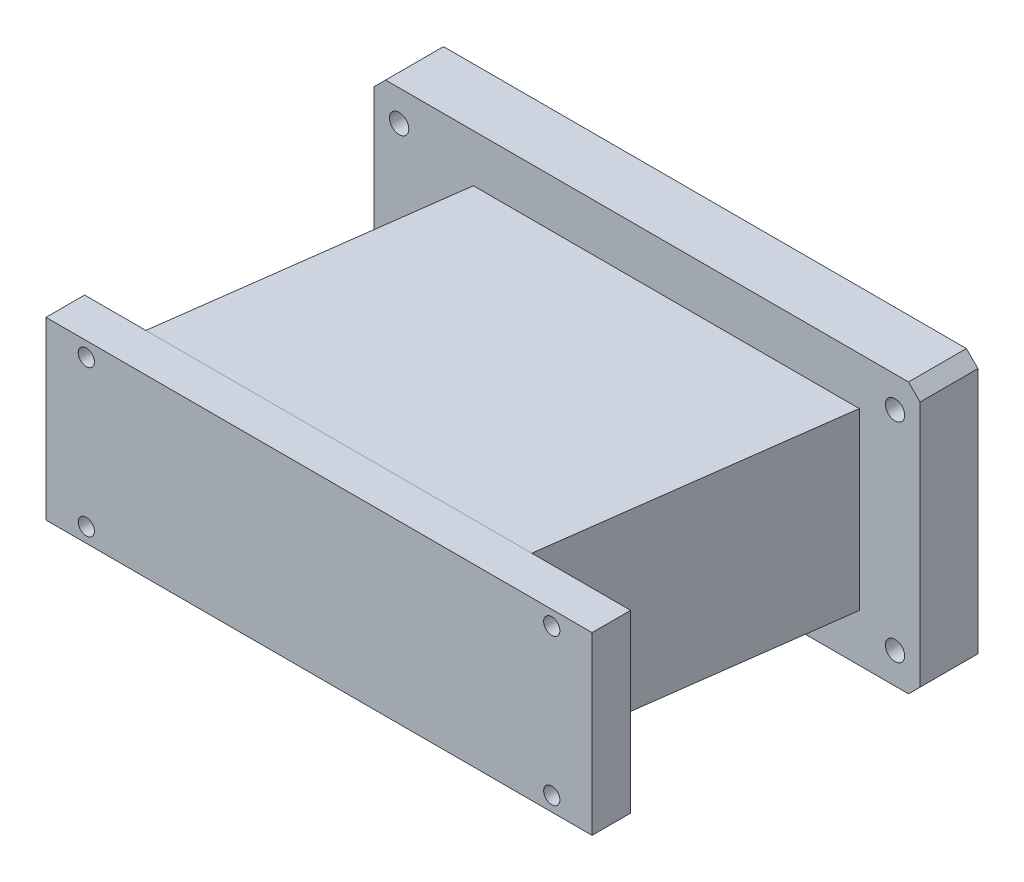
ISO-10303-21;
HEADER;
FILE_DESCRIPTION(('STEP AP214'),'2;1');
FILE_NAME('part.step','',(''),(''),'','','');
FILE_SCHEMA(('AUTOMOTIVE_DESIGN { 1 0 10303 214 1 1 1 1 }'));
ENDSEC;
DATA;
#1=APPLICATION_CONTEXT('core data for automotive mechanical design processes');
#2=APPLICATION_PROTOCOL_DEFINITION('international standard','automotive_design',2000,#1);
#3=PRODUCT_CONTEXT('',#1,'mechanical');
#4=PRODUCT('Part','Part','',(#3));
#5=PRODUCT_RELATED_PRODUCT_CATEGORY('part','',(#4));
#6=PRODUCT_DEFINITION_FORMATION('','',#4);
#7=PRODUCT_DEFINITION_CONTEXT('part definition',#1,'design');
#8=PRODUCT_DEFINITION('design','',#6,#7);
#9=PRODUCT_DEFINITION_SHAPE('','',#8);
#10=(LENGTH_UNIT() NAMED_UNIT(*) SI_UNIT(.MILLI.,.METRE.));
#11=(NAMED_UNIT(*) PLANE_ANGLE_UNIT() SI_UNIT($,.RADIAN.));
#12=(NAMED_UNIT(*) SI_UNIT($,.STERADIAN.) SOLID_ANGLE_UNIT());
#13=UNCERTAINTY_MEASURE_WITH_UNIT(LENGTH_MEASURE(1.E-05),#10,'distance_accuracy_value','');
#14=(GEOMETRIC_REPRESENTATION_CONTEXT(3) GLOBAL_UNCERTAINTY_ASSIGNED_CONTEXT((#13)) GLOBAL_UNIT_ASSIGNED_CONTEXT((#10,
#11,#12)) REPRESENTATION_CONTEXT('',''));
#15=CARTESIAN_POINT('',(0.,0.,0.));
#16=DIRECTION('',(0.,0.,1.));
#17=DIRECTION('',(1.,0.,0.));
#18=AXIS2_PLACEMENT_3D('',#15,#16,#17);
#19=CARTESIAN_POINT('',(74.28750315,-23.8901196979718,100.));
#20=DIRECTION('',(0.,0.,1.));
#21=DIRECTION('',(1.,0.,0.));
#22=AXIS2_PLACEMENT_3D('',#19,#20,#21);
#23=PLANE('',#22);
#24=DIRECTION('',(1.,0.,0.));
#25=VECTOR('',#24,1.);
#26=CARTESIAN_POINT('',(-74.28750315,-22.7524919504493,100.));
#27=LINE('',#26,#25);
#28=CARTESIAN_POINT('',(70.75,-22.7524919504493,100.));
#29=VERTEX_POINT('',#28);
#30=CARTESIAN_POINT('',(-70.75,-22.7524919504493,100.));
#31=VERTEX_POINT('',#30);
#32=EDGE_CURVE('E143',#29,#31,#27,.F.);
#33=ORIENTED_EDGE('',*,*,#32,.F.);
#34=DIRECTION('',(0.,1.,0.));
#35=VECTOR('',#34,1.);
#36=CARTESIAN_POINT('',(70.75,-23.8901196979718,100.));
#37=LINE('',#36,#35);
#38=CARTESIAN_POINT('',(70.75,22.7524919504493,100.));
#39=VERTEX_POINT('',#38);
#40=EDGE_CURVE('E126',#39,#29,#37,.F.);
#41=ORIENTED_EDGE('',*,*,#40,.F.);
#42=DIRECTION('',(1.,0.,0.));
#43=VECTOR('',#42,1.);
#44=CARTESIAN_POINT('',(-74.28750315,22.7524919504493,100.));
#45=LINE('',#44,#43);
#46=CARTESIAN_POINT('',(-70.75,22.7524919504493,100.));
#47=VERTEX_POINT('',#46);
#48=EDGE_CURVE('E131',#47,#39,#45,.T.);
#49=ORIENTED_EDGE('',*,*,#48,.F.);
#50=DIRECTION('',(0.,1.,0.));
#51=VECTOR('',#50,1.);
#52=CARTESIAN_POINT('',(-70.75,-23.8901196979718,100.));
#53=LINE('',#52,#51);
#54=EDGE_CURVE('E371',#31,#47,#53,.T.);
#55=ORIENTED_EDGE('',*,*,#54,.F.);
#56=EDGE_LOOP('',(#33,#41,#49,#55));
#57=FACE_BOUND('',#56,.T.);
#58=CARTESIAN_POINT('',(60.2999999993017,19.,100.));
#59=DIRECTION('',(0.,0.,1.));
#60=DIRECTION('',(1.,0.,0.));
#61=AXIS2_PLACEMENT_3D('',#58,#59,#60);
#62=CIRCLE('',#61,2.1);
#63=CARTESIAN_POINT('',(62.3999999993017,19.,100.));
#64=VERTEX_POINT('',#63);
#65=EDGE_CURVE('E19',#64,#64,#62,.F.);
#66=ORIENTED_EDGE('',*,*,#65,.T.);
#67=EDGE_LOOP('',(#66));
#68=FACE_BOUND('',#67,.T.);
#69=CARTESIAN_POINT('',(-60.2999999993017,19.,100.));
#70=DIRECTION('',(0.,0.,1.));
#71=DIRECTION('',(1.,0.,0.));
#72=AXIS2_PLACEMENT_3D('',#69,#70,#71);
#73=CIRCLE('',#72,2.1);
#74=CARTESIAN_POINT('',(-58.1999999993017,19.,100.));
#75=VERTEX_POINT('',#74);
#76=EDGE_CURVE('E197',#75,#75,#73,.F.);
#77=ORIENTED_EDGE('',*,*,#76,.T.);
#78=EDGE_LOOP('',(#77));
#79=FACE_BOUND('',#78,.T.);
#80=CARTESIAN_POINT('',(60.2999999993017,-19.,100.));
#81=DIRECTION('',(0.,0.,1.));
#82=DIRECTION('',(1.,0.,0.));
#83=AXIS2_PLACEMENT_3D('',#80,#81,#82);
#84=CIRCLE('',#83,2.10000000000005);
#85=CARTESIAN_POINT('',(62.3999999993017,-19.,100.));
#86=VERTEX_POINT('',#85);
#87=EDGE_CURVE('E199',#86,#86,#84,.F.);
#88=ORIENTED_EDGE('',*,*,#87,.T.);
#89=EDGE_LOOP('',(#88));
#90=FACE_BOUND('',#89,.T.);
#91=CARTESIAN_POINT('',(-60.2999999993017,-19.,100.));
#92=DIRECTION('',(0.,0.,1.));
#93=DIRECTION('',(1.,0.,0.));
#94=AXIS2_PLACEMENT_3D('',#91,#92,#93);
#95=CIRCLE('',#94,2.1);
#96=CARTESIAN_POINT('',(-58.1999999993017,-19.,100.));
#97=VERTEX_POINT('',#96);
#98=EDGE_CURVE('E140',#97,#97,#95,.F.);
#99=ORIENTED_EDGE('',*,*,#98,.T.);
#100=EDGE_LOOP('',(#99));
#101=FACE_BOUND('',#100,.T.);
#102=ADVANCED_FACE('F16',(#57,#68,#79,#90,#101),#23,.T.);
#103=CARTESIAN_POINT('',(60.2999999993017,19.,89.74999685));
#104=DIRECTION('',(0.,0.,1.));
#105=DIRECTION('',(1.,0.,0.));
#106=AXIS2_PLACEMENT_3D('',#103,#104,#105);
#107=CYLINDRICAL_SURFACE('',#106,2.1);
#108=CARTESIAN_POINT('',(60.2999999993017,19.,90.));
#109=DIRECTION('',(0.,0.,1.));
#110=DIRECTION('',(1.,0.,0.));
#111=AXIS2_PLACEMENT_3D('',#108,#109,#110);
#112=CIRCLE('',#111,2.1);
#113=CARTESIAN_POINT('',(62.3999999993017,19.,90.));
#114=VERTEX_POINT('',#113);
#115=EDGE_CURVE('E192',#114,#114,#112,.T.);
#116=ORIENTED_EDGE('',*,*,#115,.F.);
#117=EDGE_LOOP('',(#116));
#118=FACE_BOUND('',#117,.T.);
#119=ORIENTED_EDGE('',*,*,#65,.F.);
#120=EDGE_LOOP('',(#119));
#121=FACE_BOUND('',#120,.T.);
#122=ADVANCED_FACE('F207',(#118,#121),#107,.F.);
#123=CARTESIAN_POINT('',(60.2999999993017,-19.,89.74999685));
#124=DIRECTION('',(0.,0.,1.));
#125=DIRECTION('',(1.,0.,0.));
#126=AXIS2_PLACEMENT_3D('',#123,#124,#125);
#127=CYLINDRICAL_SURFACE('',#126,2.10000000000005);
#128=ORIENTED_EDGE('',*,*,#87,.F.);
#129=EDGE_LOOP('',(#128));
#130=FACE_BOUND('',#129,.T.);
#131=CARTESIAN_POINT('',(60.2999999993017,-19.,90.));
#132=DIRECTION('',(0.,0.,1.));
#133=DIRECTION('',(1.,0.,0.));
#134=AXIS2_PLACEMENT_3D('',#131,#132,#133);
#135=CIRCLE('',#134,2.10000000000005);
#136=CARTESIAN_POINT('',(62.3999999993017,-19.,90.));
#137=VERTEX_POINT('',#136);
#138=EDGE_CURVE('E189',#137,#137,#135,.T.);
#139=ORIENTED_EDGE('',*,*,#138,.F.);
#140=EDGE_LOOP('',(#139));
#141=FACE_BOUND('',#140,.T.);
#142=ADVANCED_FACE('F209',(#130,#141),#127,.F.);
#143=CARTESIAN_POINT('',(-60.2999999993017,19.,89.74999685));
#144=DIRECTION('',(0.,0.,1.));
#145=DIRECTION('',(1.,0.,0.));
#146=AXIS2_PLACEMENT_3D('',#143,#144,#145);
#147=CYLINDRICAL_SURFACE('',#146,2.1);
#148=CARTESIAN_POINT('',(-60.2999999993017,19.,90.));
#149=DIRECTION('',(0.,0.,1.));
#150=DIRECTION('',(1.,0.,0.));
#151=AXIS2_PLACEMENT_3D('',#148,#149,#150);
#152=CIRCLE('',#151,2.1);
#153=CARTESIAN_POINT('',(-58.1999999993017,19.,90.));
#154=VERTEX_POINT('',#153);
#155=EDGE_CURVE('E186',#154,#154,#152,.T.);
#156=ORIENTED_EDGE('',*,*,#155,.F.);
#157=EDGE_LOOP('',(#156));
#158=FACE_BOUND('',#157,.T.);
#159=ORIENTED_EDGE('',*,*,#76,.F.);
#160=EDGE_LOOP('',(#159));
#161=FACE_BOUND('',#160,.T.);
#162=ADVANCED_FACE('F217',(#158,#161),#147,.F.);
#163=CARTESIAN_POINT('',(-60.2999999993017,-19.,89.74999685));
#164=DIRECTION('',(0.,0.,1.));
#165=DIRECTION('',(1.,0.,0.));
#166=AXIS2_PLACEMENT_3D('',#163,#164,#165);
#167=CYLINDRICAL_SURFACE('',#166,2.1);
#168=CARTESIAN_POINT('',(-60.2999999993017,-19.,90.));
#169=DIRECTION('',(0.,0.,1.));
#170=DIRECTION('',(1.,0.,0.));
#171=AXIS2_PLACEMENT_3D('',#168,#169,#170);
#172=CIRCLE('',#171,2.1);
#173=CARTESIAN_POINT('',(-58.1999999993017,-19.,90.));
#174=VERTEX_POINT('',#173);
#175=EDGE_CURVE('E182',#174,#174,#172,.T.);
#176=ORIENTED_EDGE('',*,*,#175,.F.);
#177=EDGE_LOOP('',(#176));
#178=FACE_BOUND('',#177,.T.);
#179=ORIENTED_EDGE('',*,*,#98,.F.);
#180=EDGE_LOOP('',(#179));
#181=FACE_BOUND('',#180,.T.);
#182=ADVANCED_FACE('F314',(#178,#181),#167,.F.);
#183=CARTESIAN_POINT('',(-74.28750315,22.7524919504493,89.74999685));
#184=DIRECTION('',(0.,1.,0.));
#185=DIRECTION('',(0.,0.,1.));
#186=AXIS2_PLACEMENT_3D('',#183,#184,#185);
#187=PLANE('',#186);
#188=ORIENTED_EDGE('',*,*,#48,.T.);
#189=DIRECTION('',(0.,0.,-1.));
#190=VECTOR('',#189,1.);
#191=CARTESIAN_POINT('',(70.75,22.7524919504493,100.25000315));
#192=LINE('',#191,#190);
#193=CARTESIAN_POINT('',(70.75,22.7524919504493,90.));
#194=VERTEX_POINT('',#193);
#195=EDGE_CURVE('E133',#194,#39,#192,.F.);
#196=ORIENTED_EDGE('',*,*,#195,.F.);
#197=DIRECTION('',(-1.,0.,0.));
#198=VECTOR('',#197,1.);
#199=CARTESIAN_POINT('',(74.28750315,22.7524919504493,90.));
#200=LINE('',#199,#198);
#201=CARTESIAN_POINT('',(-70.75,22.7524919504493,90.));
#202=VERTEX_POINT('',#201);
#203=EDGE_CURVE('E185',#202,#194,#200,.F.);
#204=ORIENTED_EDGE('',*,*,#203,.F.);
#205=DIRECTION('',(0.,0.,1.));
#206=VECTOR('',#205,1.);
#207=CARTESIAN_POINT('',(-70.75,22.7524919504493,89.74999685));
#208=LINE('',#207,#206);
#209=EDGE_CURVE('E136',#47,#202,#208,.F.);
#210=ORIENTED_EDGE('',*,*,#209,.F.);
#211=EDGE_LOOP('',(#188,#196,#204,#210));
#212=FACE_BOUND('',#211,.T.);
#213=ADVANCED_FACE('F132',(#212),#187,.T.);
#214=CARTESIAN_POINT('',(70.75,-23.8901196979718,100.25000315));
#215=DIRECTION('',(1.,0.,0.));
#216=DIRECTION('',(0.,0.,-1.));
#217=AXIS2_PLACEMENT_3D('',#214,#215,#216);
#218=PLANE('',#217);
#219=ORIENTED_EDGE('',*,*,#40,.T.);
#220=DIRECTION('',(0.,0.,-1.));
#221=VECTOR('',#220,1.);
#222=CARTESIAN_POINT('',(70.75,-22.7524919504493,100.25000315));
#223=LINE('',#222,#221);
#224=CARTESIAN_POINT('',(70.75,-22.7524919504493,90.));
#225=VERTEX_POINT('',#224);
#226=EDGE_CURVE('E145',#225,#29,#223,.F.);
#227=ORIENTED_EDGE('',*,*,#226,.F.);
#228=DIRECTION('',(0.,1.,0.));
#229=VECTOR('',#228,1.);
#230=CARTESIAN_POINT('',(70.75,-23.8901196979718,90.));
#231=LINE('',#230,#229);
#232=EDGE_CURVE('E149',#194,#225,#231,.F.);
#233=ORIENTED_EDGE('',*,*,#232,.F.);
#234=ORIENTED_EDGE('',*,*,#195,.T.);
#235=EDGE_LOOP('',(#219,#227,#233,#234));
#236=FACE_BOUND('',#235,.T.);
#237=ADVANCED_FACE('F147',(#236),#218,.T.);
#238=CARTESIAN_POINT('',(-74.28750315,-22.7524919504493,100.25000315));
#239=DIRECTION('',(0.,-1.,0.));
#240=DIRECTION('',(0.,0.,-1.));
#241=AXIS2_PLACEMENT_3D('',#238,#239,#240);
#242=PLANE('',#241);
#243=ORIENTED_EDGE('',*,*,#32,.T.);
#244=DIRECTION('',(0.,0.,1.));
#245=VECTOR('',#244,1.);
#246=CARTESIAN_POINT('',(-70.75,-22.7524919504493,89.74999685));
#247=LINE('',#246,#245);
#248=CARTESIAN_POINT('',(-70.75,-22.7524919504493,90.));
#249=VERTEX_POINT('',#248);
#250=EDGE_CURVE('E373',#249,#31,#247,.T.);
#251=ORIENTED_EDGE('',*,*,#250,.F.);
#252=DIRECTION('',(-1.,0.,0.));
#253=VECTOR('',#252,1.);
#254=CARTESIAN_POINT('',(74.28750315,-22.7524919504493,90.));
#255=LINE('',#254,#253);
#256=EDGE_CURVE('E365',#225,#249,#255,.T.);
#257=ORIENTED_EDGE('',*,*,#256,.F.);
#258=ORIENTED_EDGE('',*,*,#226,.T.);
#259=EDGE_LOOP('',(#243,#251,#257,#258));
#260=FACE_BOUND('',#259,.T.);
#261=ADVANCED_FACE('F305',(#260),#242,.T.);
#262=CARTESIAN_POINT('',(-70.75,-23.8901196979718,89.74999685));
#263=DIRECTION('',(-1.,0.,0.));
#264=DIRECTION('',(0.,0.,1.));
#265=AXIS2_PLACEMENT_3D('',#262,#263,#264);
#266=PLANE('',#265);
#267=ORIENTED_EDGE('',*,*,#54,.T.);
#268=ORIENTED_EDGE('',*,*,#209,.T.);
#269=DIRECTION('',(0.,1.,0.));
#270=VECTOR('',#269,1.);
#271=CARTESIAN_POINT('',(-70.75,-23.8901196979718,90.));
#272=LINE('',#271,#270);
#273=EDGE_CURVE('E362',#249,#202,#272,.T.);
#274=ORIENTED_EDGE('',*,*,#273,.F.);
#275=ORIENTED_EDGE('',*,*,#250,.T.);
#276=EDGE_LOOP('',(#267,#268,#274,#275));
#277=FACE_BOUND('',#276,.T.);
#278=ADVANCED_FACE('F301',(#277),#266,.T.);
#279=CARTESIAN_POINT('',(74.28750315,-23.8901196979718,90.));
#280=DIRECTION('',(0.,0.,-1.));
#281=DIRECTION('',(-1.,0.,0.));
#282=AXIS2_PLACEMENT_3D('',#279,#280,#281);
#283=PLANE('',#282);
#284=ORIENTED_EDGE('',*,*,#256,.T.);
#285=ORIENTED_EDGE('',*,*,#273,.T.);
#286=ORIENTED_EDGE('',*,*,#203,.T.);
#287=ORIENTED_EDGE('',*,*,#232,.T.);
#288=EDGE_LOOP('',(#284,#285,#286,#287));
#289=FACE_BOUND('',#288,.T.);
#290=ORIENTED_EDGE('',*,*,#175,.T.);
#291=EDGE_LOOP('',(#290));
#292=FACE_BOUND('',#291,.T.);
#293=ORIENTED_EDGE('',*,*,#155,.T.);
#294=EDGE_LOOP('',(#293));
#295=FACE_BOUND('',#294,.T.);
#296=DIRECTION('',(1.,0.,0.));
#297=VECTOR('',#296,1.);
#298=CARTESIAN_POINT('',(-57.75000315,-22.65,90.));
#299=LINE('',#298,#297);
#300=CARTESIAN_POINT('',(45.,-22.65,90.));
#301=VERTEX_POINT('',#300);
#302=CARTESIAN_POINT('',(-55.,-22.65,90.));
#303=VERTEX_POINT('',#302);
#304=EDGE_CURVE('E334',#301,#303,#299,.F.);
#305=ORIENTED_EDGE('',*,*,#304,.F.);
#306=DIRECTION('',(0.,1.,0.));
#307=VECTOR('',#306,1.);
#308=CARTESIAN_POINT('',(45.,-23.78250315,90.));
#309=LINE('',#308,#307);
#310=CARTESIAN_POINT('',(45.,22.65,90.));
#311=VERTEX_POINT('',#310);
#312=EDGE_CURVE('E339',#311,#301,#309,.F.);
#313=ORIENTED_EDGE('',*,*,#312,.F.);
#314=DIRECTION('',(1.,0.,0.));
#315=VECTOR('',#314,1.);
#316=CARTESIAN_POINT('',(-57.75000315,22.65,90.));
#317=LINE('',#316,#315);
#318=CARTESIAN_POINT('',(-55.,22.65,90.));
#319=VERTEX_POINT('',#318);
#320=EDGE_CURVE('E360',#319,#311,#317,.T.);
#321=ORIENTED_EDGE('',*,*,#320,.F.);
#322=DIRECTION('',(0.,1.,0.));
#323=VECTOR('',#322,1.);
#324=CARTESIAN_POINT('',(-55.,-23.78250315,90.));
#325=LINE('',#324,#323);
#326=EDGE_CURVE('E342',#303,#319,#325,.T.);
#327=ORIENTED_EDGE('',*,*,#326,.F.);
#328=EDGE_LOOP('',(#305,#313,#321,#327));
#329=FACE_BOUND('',#328,.T.);
#330=ORIENTED_EDGE('',*,*,#138,.T.);
#331=EDGE_LOOP('',(#330));
#332=FACE_BOUND('',#331,.T.);
#333=ORIENTED_EDGE('',*,*,#115,.T.);
#334=EDGE_LOOP('',(#333));
#335=FACE_BOUND('',#334,.T.);
#336=ADVANCED_FACE('F297',(#289,#292,#295,#329,#332,#335),#283,.T.);
#337=CARTESIAN_POINT('',(-57.75000315,22.65,91.87500315));
#338=DIRECTION('',(0.,1.,0.));
#339=DIRECTION('',(0.,0.,1.));
#340=AXIS2_PLACEMENT_3D('',#337,#338,#339);
#341=PLANE('',#340);
#342=DIRECTION('',(1.,0.,0.));
#343=VECTOR('',#342,1.);
#344=CARTESIAN_POINT('',(74.28750315,22.65,15.));
#345=LINE('',#344,#343);
#346=CARTESIAN_POINT('',(-45.,22.65,15.));
#347=VERTEX_POINT('',#346);
#348=CARTESIAN_POINT('',(55.,22.65,15.));
#349=VERTEX_POINT('',#348);
#350=EDGE_CURVE('E384',#347,#349,#345,.T.);
#351=ORIENTED_EDGE('',*,*,#350,.F.);
#352=DIRECTION('',(-0.132163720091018,0.,0.991227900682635));
#353=VECTOR('',#352,1.);
#354=CARTESIAN_POINT('',(-55.2500004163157,22.65,91.8750031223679));
#355=LINE('',#354,#353);
#356=EDGE_CURVE('E382',#319,#347,#355,.F.);
#357=ORIENTED_EDGE('',*,*,#356,.F.);
#358=ORIENTED_EDGE('',*,*,#320,.T.);
#359=DIRECTION('',(0.132163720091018,0.,-0.991227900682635));
#360=VECTOR('',#359,1.);
#361=CARTESIAN_POINT('',(55.2500004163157,22.65,13.1249968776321));
#362=LINE('',#361,#360);
#363=EDGE_CURVE('E349',#349,#311,#362,.F.);
#364=ORIENTED_EDGE('',*,*,#363,.F.);
#365=EDGE_LOOP('',(#351,#357,#358,#364));
#366=FACE_BOUND('',#365,.T.);
#367=ADVANCED_FACE('F293',(#366),#341,.T.);
#368=CARTESIAN_POINT('',(55.2500004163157,-23.78250315,13.1249968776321));
#369=DIRECTION('',(0.991227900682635,0.,0.132163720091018));
#370=DIRECTION('',(0.132163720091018,0.,-0.991227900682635));
#371=AXIS2_PLACEMENT_3D('',#368,#369,#370);
#372=PLANE('',#371);
#373=DIRECTION('',(-0.132163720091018,0.,0.991227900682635));
#374=VECTOR('',#373,1.);
#375=CARTESIAN_POINT('',(55.,-22.65,15.));
#376=LINE('',#375,#374);
#377=CARTESIAN_POINT('',(55.,-22.65,15.));
#378=VERTEX_POINT('',#377);
#379=EDGE_CURVE('E345',#378,#301,#376,.T.);
#380=ORIENTED_EDGE('',*,*,#379,.F.);
#381=DIRECTION('',(0.,1.,0.));
#382=VECTOR('',#381,1.);
#383=CARTESIAN_POINT('',(55.,-36.75000315,15.));
#384=LINE('',#383,#382);
#385=EDGE_CURVE('E390',#349,#378,#384,.F.);
#386=ORIENTED_EDGE('',*,*,#385,.F.);
#387=ORIENTED_EDGE('',*,*,#363,.T.);
#388=ORIENTED_EDGE('',*,*,#312,.T.);
#389=EDGE_LOOP('',(#380,#386,#387,#388));
#390=FACE_BOUND('',#389,.T.);
#391=ADVANCED_FACE('F289',(#390),#372,.T.);
#392=CARTESIAN_POINT('',(-57.75000315,-22.65,13.12499685));
#393=DIRECTION('',(0.,-1.,0.));
#394=DIRECTION('',(0.,0.,-1.));
#395=AXIS2_PLACEMENT_3D('',#392,#393,#394);
#396=PLANE('',#395);
#397=DIRECTION('',(1.,0.,0.));
#398=VECTOR('',#397,1.);
#399=CARTESIAN_POINT('',(74.28750315,-22.65,15.));
#400=LINE('',#399,#398);
#401=CARTESIAN_POINT('',(-45.,-22.65,15.));
#402=VERTEX_POINT('',#401);
#403=EDGE_CURVE('E352',#378,#402,#400,.F.);
#404=ORIENTED_EDGE('',*,*,#403,.F.);
#405=ORIENTED_EDGE('',*,*,#379,.T.);
#406=ORIENTED_EDGE('',*,*,#304,.T.);
#407=DIRECTION('',(-0.132163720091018,0.,0.991227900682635));
#408=VECTOR('',#407,1.);
#409=CARTESIAN_POINT('',(-55.2500004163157,-22.65,91.8750031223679));
#410=LINE('',#409,#408);
#411=EDGE_CURVE('E354',#402,#303,#410,.T.);
#412=ORIENTED_EDGE('',*,*,#411,.F.);
#413=EDGE_LOOP('',(#404,#405,#406,#412));
#414=FACE_BOUND('',#413,.T.);
#415=ADVANCED_FACE('F285',(#414),#396,.T.);
#416=CARTESIAN_POINT('',(-55.2500004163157,-23.78250315,91.8750031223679));
#417=DIRECTION('',(-0.991227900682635,0.,-0.132163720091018));
#418=DIRECTION('',(-0.132163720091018,0.,0.991227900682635));
#419=AXIS2_PLACEMENT_3D('',#416,#417,#418);
#420=PLANE('',#419);
#421=ORIENTED_EDGE('',*,*,#326,.T.);
#422=ORIENTED_EDGE('',*,*,#356,.T.);
#423=DIRECTION('',(0.,1.,0.));
#424=VECTOR('',#423,1.);
#425=CARTESIAN_POINT('',(-45.,-36.75000315,15.));
#426=LINE('',#425,#424);
#427=EDGE_CURVE('E181',#402,#347,#426,.T.);
#428=ORIENTED_EDGE('',*,*,#427,.F.);
#429=ORIENTED_EDGE('',*,*,#411,.T.);
#430=EDGE_LOOP('',(#421,#422,#428,#429));
#431=FACE_BOUND('',#430,.T.);
#432=ADVANCED_FACE('F281',(#431),#420,.T.);
#433=CARTESIAN_POINT('',(74.28750315,-36.75000315,15.));
#434=DIRECTION('',(0.,0.,1.));
#435=DIRECTION('',(1.,0.,0.));
#436=AXIS2_PLACEMENT_3D('',#433,#434,#435);
#437=PLANE('',#436);
#438=DIRECTION('',(0.707106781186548,-0.707106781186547,0.));
#439=VECTOR('',#438,1.);
#440=CARTESIAN_POINT('',(-70.8250022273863,-31.9249977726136,15.));
#441=LINE('',#440,#439);
#442=CARTESIAN_POINT('',(-67.75,-35.,15.));
#443=VERTEX_POINT('',#442);
#444=CARTESIAN_POINT('',(-70.75,-32.,15.));
#445=VERTEX_POINT('',#444);
#446=EDGE_CURVE('E419',#443,#445,#441,.F.);
#447=ORIENTED_EDGE('',*,*,#446,.F.);
#448=DIRECTION('',(1.,0.,0.));
#449=VECTOR('',#448,1.);
#450=CARTESIAN_POINT('',(-71.13750315,-35.,15.));
#451=LINE('',#450,#449);
#452=CARTESIAN_POINT('',(67.75,-35.,15.));
#453=VERTEX_POINT('',#452);
#454=EDGE_CURVE('E414',#453,#443,#451,.F.);
#455=ORIENTED_EDGE('',*,*,#454,.F.);
#456=DIRECTION('',(0.707106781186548,0.707106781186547,0.));
#457=VECTOR('',#456,1.);
#458=CARTESIAN_POINT('',(70.8250022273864,-31.9249977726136,15.));
#459=LINE('',#458,#457);
#460=CARTESIAN_POINT('',(70.75,-32.,15.));
#461=VERTEX_POINT('',#460);
#462=EDGE_CURVE('E409',#461,#453,#459,.F.);
#463=ORIENTED_EDGE('',*,*,#462,.F.);
#464=DIRECTION('',(0.,1.,0.));
#465=VECTOR('',#464,1.);
#466=CARTESIAN_POINT('',(70.75,-33.60000315,15.));
#467=LINE('',#466,#465);
#468=CARTESIAN_POINT('',(70.75,32.,15.));
#469=VERTEX_POINT('',#468);
#470=EDGE_CURVE('E401',#469,#461,#467,.F.);
#471=ORIENTED_EDGE('',*,*,#470,.F.);
#472=DIRECTION('',(-0.707106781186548,0.707106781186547,0.));
#473=VECTOR('',#472,1.);
#474=CARTESIAN_POINT('',(70.8250022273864,31.9249977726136,15.));
#475=LINE('',#474,#473);
#476=CARTESIAN_POINT('',(67.75,35.,15.));
#477=VERTEX_POINT('',#476);
#478=EDGE_CURVE('E398',#477,#469,#475,.F.);
#479=ORIENTED_EDGE('',*,*,#478,.F.);
#480=DIRECTION('',(1.,0.,0.));
#481=VECTOR('',#480,1.);
#482=CARTESIAN_POINT('',(-71.13750315,35.,15.));
#483=LINE('',#482,#481);
#484=CARTESIAN_POINT('',(-67.75,35.,15.));
#485=VERTEX_POINT('',#484);
#486=EDGE_CURVE('E171',#485,#477,#483,.T.);
#487=ORIENTED_EDGE('',*,*,#486,.F.);
#488=DIRECTION('',(-0.707106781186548,-0.707106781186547,0.));
#489=VECTOR('',#488,1.);
#490=CARTESIAN_POINT('',(-67.6749977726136,35.0750022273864,15.));
#491=LINE('',#490,#489);
#492=CARTESIAN_POINT('',(-70.75,32.,15.));
#493=VERTEX_POINT('',#492);
#494=EDGE_CURVE('E428',#493,#485,#491,.F.);
#495=ORIENTED_EDGE('',*,*,#494,.F.);
#496=DIRECTION('',(0.,1.,0.));
#497=VECTOR('',#496,1.);
#498=CARTESIAN_POINT('',(-70.75,-33.60000315,15.));
#499=LINE('',#498,#497);
#500=EDGE_CURVE('E422',#445,#493,#499,.T.);
#501=ORIENTED_EDGE('',*,*,#500,.F.);
#502=EDGE_LOOP('',(#447,#455,#463,#471,#479,#487,#495,#501));
#503=FACE_BOUND('',#502,.T.);
#504=CARTESIAN_POINT('',(-64.249999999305,27.,15.));
#505=DIRECTION('',(0.,0.,1.));
#506=DIRECTION('',(1.,0.,0.));
#507=AXIS2_PLACEMENT_3D('',#504,#505,#506);
#508=CIRCLE('',#507,2.5);
#509=CARTESIAN_POINT('',(-61.749999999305,27.,15.));
#510=VERTEX_POINT('',#509);
#511=EDGE_CURVE('E175',#510,#510,#508,.F.);
#512=ORIENTED_EDGE('',*,*,#511,.T.);
#513=EDGE_LOOP('',(#512));
#514=FACE_BOUND('',#513,.T.);
#515=CARTESIAN_POINT('',(-64.2499999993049,-27.,15.));
#516=DIRECTION('',(0.,0.,1.));
#517=DIRECTION('',(0.,-1.,0.));
#518=AXIS2_PLACEMENT_3D('',#515,#516,#517);
#519=CIRCLE('',#518,2.49999999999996);
#520=CARTESIAN_POINT('',(-64.2499999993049,-29.5,15.));
#521=VERTEX_POINT('',#520);
#522=EDGE_CURVE('E172',#521,#521,#519,.F.);
#523=ORIENTED_EDGE('',*,*,#522,.T.);
#524=EDGE_LOOP('',(#523));
#525=FACE_BOUND('',#524,.T.);
#526=ORIENTED_EDGE('',*,*,#403,.T.);
#527=ORIENTED_EDGE('',*,*,#427,.T.);
#528=ORIENTED_EDGE('',*,*,#350,.T.);
#529=ORIENTED_EDGE('',*,*,#385,.T.);
#530=EDGE_LOOP('',(#526,#527,#528,#529));
#531=FACE_BOUND('',#530,.T.);
#532=CARTESIAN_POINT('',(64.2499999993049,-27.,15.));
#533=DIRECTION('',(0.,0.,1.));
#534=DIRECTION('',(1.,0.,0.));
#535=AXIS2_PLACEMENT_3D('',#532,#533,#534);
#536=CIRCLE('',#535,2.5);
#537=CARTESIAN_POINT('',(66.7499999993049,-27.,15.));
#538=VERTEX_POINT('',#537);
#539=EDGE_CURVE('E178',#538,#538,#536,.F.);
#540=ORIENTED_EDGE('',*,*,#539,.T.);
#541=EDGE_LOOP('',(#540));
#542=FACE_BOUND('',#541,.T.);
#543=CARTESIAN_POINT('',(64.249999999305,27.,15.));
#544=DIRECTION('',(0.,0.,1.));
#545=DIRECTION('',(0.,-1.,0.));
#546=AXIS2_PLACEMENT_3D('',#543,#544,#545);
#547=CIRCLE('',#546,2.50000000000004);
#548=CARTESIAN_POINT('',(64.249999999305,24.5,15.));
#549=VERTEX_POINT('',#548);
#550=EDGE_CURVE('E168',#549,#549,#547,.F.);
#551=ORIENTED_EDGE('',*,*,#550,.T.);
#552=EDGE_LOOP('',(#551));
#553=FACE_BOUND('',#552,.T.);
#554=ADVANCED_FACE('F277',(#503,#514,#525,#531,#542,#553),#437,.T.);
#555=CARTESIAN_POINT('',(64.2499999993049,-27.,-0.37500315));
#556=DIRECTION('',(0.,0.,1.));
#557=DIRECTION('',(1.,0.,0.));
#558=AXIS2_PLACEMENT_3D('',#555,#556,#557);
#559=CYLINDRICAL_SURFACE('',#558,2.5);
#560=ORIENTED_EDGE('',*,*,#539,.F.);
#561=EDGE_LOOP('',(#560));
#562=FACE_BOUND('',#561,.T.);
#563=CARTESIAN_POINT('',(64.2499999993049,-27.,0.));
#564=DIRECTION('',(0.,0.,1.));
#565=DIRECTION('',(1.,0.,0.));
#566=AXIS2_PLACEMENT_3D('',#563,#564,#565);
#567=CIRCLE('',#566,2.5);
#568=CARTESIAN_POINT('',(66.7499999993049,-27.,0.));
#569=VERTEX_POINT('',#568);
#570=EDGE_CURVE('E164',#569,#569,#567,.T.);
#571=ORIENTED_EDGE('',*,*,#570,.F.);
#572=EDGE_LOOP('',(#571));
#573=FACE_BOUND('',#572,.T.);
#574=ADVANCED_FACE('F273',(#562,#573),#559,.F.);
#575=CARTESIAN_POINT('',(-64.249999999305,27.,-0.37500315));
#576=DIRECTION('',(0.,0.,1.));
#577=DIRECTION('',(1.,0.,0.));
#578=AXIS2_PLACEMENT_3D('',#575,#576,#577);
#579=CYLINDRICAL_SURFACE('',#578,2.5);
#580=CARTESIAN_POINT('',(-64.249999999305,27.,0.));
#581=DIRECTION('',(0.,0.,1.));
#582=DIRECTION('',(1.,0.,0.));
#583=AXIS2_PLACEMENT_3D('',#580,#581,#582);
#584=CIRCLE('',#583,2.5);
#585=CARTESIAN_POINT('',(-61.749999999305,27.,0.));
#586=VERTEX_POINT('',#585);
#587=EDGE_CURVE('E161',#586,#586,#584,.T.);
#588=ORIENTED_EDGE('',*,*,#587,.F.);
#589=EDGE_LOOP('',(#588));
#590=FACE_BOUND('',#589,.T.);
#591=ORIENTED_EDGE('',*,*,#511,.F.);
#592=EDGE_LOOP('',(#591));
#593=FACE_BOUND('',#592,.T.);
#594=ADVANCED_FACE('F269',(#590,#593),#579,.F.);
#595=CARTESIAN_POINT('',(-64.2499999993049,-27.,-0.375003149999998));
#596=DIRECTION('',(0.,0.,1.));
#597=DIRECTION('',(0.,-1.,0.));
#598=AXIS2_PLACEMENT_3D('',#595,#596,#597);
#599=CYLINDRICAL_SURFACE('',#598,2.49999999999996);
#600=CARTESIAN_POINT('',(-64.2499999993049,-27.,0.));
#601=DIRECTION('',(0.,0.,1.));
#602=DIRECTION('',(0.,-1.,0.));
#603=AXIS2_PLACEMENT_3D('',#600,#601,#602);
#604=CIRCLE('',#603,2.49999999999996);
#605=CARTESIAN_POINT('',(-64.2499999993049,-29.5,0.));
#606=VERTEX_POINT('',#605);
#607=EDGE_CURVE('E158',#606,#606,#604,.T.);
#608=ORIENTED_EDGE('',*,*,#607,.F.);
#609=EDGE_LOOP('',(#608));
#610=FACE_BOUND('',#609,.T.);
#611=ORIENTED_EDGE('',*,*,#522,.F.);
#612=EDGE_LOOP('',(#611));
#613=FACE_BOUND('',#612,.T.);
#614=ADVANCED_FACE('F265',(#610,#613),#599,.F.);
#615=CARTESIAN_POINT('',(64.249999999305,27.,-0.375003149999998));
#616=DIRECTION('',(0.,0.,1.));
#617=DIRECTION('',(0.,-1.,0.));
#618=AXIS2_PLACEMENT_3D('',#615,#616,#617);
#619=CYLINDRICAL_SURFACE('',#618,2.50000000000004);
#620=CARTESIAN_POINT('',(64.249999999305,27.,0.));
#621=DIRECTION('',(0.,0.,1.));
#622=DIRECTION('',(0.,-1.,0.));
#623=AXIS2_PLACEMENT_3D('',#620,#621,#622);
#624=CIRCLE('',#623,2.50000000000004);
#625=CARTESIAN_POINT('',(64.249999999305,24.5,0.));
#626=VERTEX_POINT('',#625);
#627=EDGE_CURVE('E154',#626,#626,#624,.T.);
#628=ORIENTED_EDGE('',*,*,#627,.F.);
#629=EDGE_LOOP('',(#628));
#630=FACE_BOUND('',#629,.T.);
#631=ORIENTED_EDGE('',*,*,#550,.F.);
#632=EDGE_LOOP('',(#631));
#633=FACE_BOUND('',#632,.T.);
#634=ADVANCED_FACE('F261',(#630,#633),#619,.F.);
#635=CARTESIAN_POINT('',(-71.13750315,35.,15.37500315));
#636=DIRECTION('',(0.,1.,0.));
#637=DIRECTION('',(0.,0.,1.));
#638=AXIS2_PLACEMENT_3D('',#635,#636,#637);
#639=PLANE('',#638);
#640=DIRECTION('',(-1.,0.,0.));
#641=VECTOR('',#640,1.);
#642=CARTESIAN_POINT('',(74.28750315,35.,0.));
#643=LINE('',#642,#641);
#644=CARTESIAN_POINT('',(-67.75,35.,0.));
#645=VERTEX_POINT('',#644);
#646=CARTESIAN_POINT('',(67.75,35.,0.));
#647=VERTEX_POINT('',#646);
#648=EDGE_CURVE('E157',#645,#647,#643,.F.);
#649=ORIENTED_EDGE('',*,*,#648,.F.);
#650=DIRECTION('',(0.,0.,1.));
#651=VECTOR('',#650,1.);
#652=CARTESIAN_POINT('',(-67.75,35.,15.37500315));
#653=LINE('',#652,#651);
#654=EDGE_CURVE('E167',#485,#645,#653,.F.);
#655=ORIENTED_EDGE('',*,*,#654,.F.);
#656=ORIENTED_EDGE('',*,*,#486,.T.);
#657=DIRECTION('',(0.,0.,1.));
#658=VECTOR('',#657,1.);
#659=CARTESIAN_POINT('',(67.75,35.,15.37500315));
#660=LINE('',#659,#658);
#661=EDGE_CURVE('E395',#647,#477,#660,.T.);
#662=ORIENTED_EDGE('',*,*,#661,.F.);
#663=EDGE_LOOP('',(#649,#655,#656,#662));
#664=FACE_BOUND('',#663,.T.);
#665=ADVANCED_FACE('F257',(#664),#639,.T.);
#666=CARTESIAN_POINT('',(70.8250022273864,31.9249977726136,15.37500315));
#667=DIRECTION('',(0.707106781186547,0.707106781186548,0.));
#668=DIRECTION('',(-0.707106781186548,0.707106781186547,0.));
#669=AXIS2_PLACEMENT_3D('',#666,#667,#668);
#670=PLANE('',#669);
#671=ORIENTED_EDGE('',*,*,#478,.T.);
#672=DIRECTION('',(0.,0.,-1.));
#673=VECTOR('',#672,1.);
#674=CARTESIAN_POINT('',(70.75,32.,-0.37500315));
#675=LINE('',#674,#673);
#676=CARTESIAN_POINT('',(70.75,32.,0.));
#677=VERTEX_POINT('',#676);
#678=EDGE_CURVE('E403',#677,#469,#675,.F.);
#679=ORIENTED_EDGE('',*,*,#678,.F.);
#680=DIRECTION('',(0.707106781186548,-0.707106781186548,0.));
#681=VECTOR('',#680,1.);
#682=CARTESIAN_POINT('',(67.75,35.,0.));
#683=LINE('',#682,#681);
#684=EDGE_CURVE('E435',#647,#677,#683,.T.);
#685=ORIENTED_EDGE('',*,*,#684,.F.);
#686=ORIENTED_EDGE('',*,*,#661,.T.);
#687=EDGE_LOOP('',(#671,#679,#685,#686));
#688=FACE_BOUND('',#687,.T.);
#689=ADVANCED_FACE('F253',(#688),#670,.T.);
#690=CARTESIAN_POINT('',(70.75,-33.60000315,-0.37500315));
#691=DIRECTION('',(1.,0.,0.));
#692=DIRECTION('',(0.,0.,-1.));
#693=AXIS2_PLACEMENT_3D('',#690,#691,#692);
#694=PLANE('',#693);
#695=DIRECTION('',(0.,1.,0.));
#696=VECTOR('',#695,1.);
#697=CARTESIAN_POINT('',(70.75,-36.75000315,0.));
#698=LINE('',#697,#696);
#699=CARTESIAN_POINT('',(70.75,-32.,0.));
#700=VERTEX_POINT('',#699);
#701=EDGE_CURVE('E438',#677,#700,#698,.F.);
#702=ORIENTED_EDGE('',*,*,#701,.F.);
#703=ORIENTED_EDGE('',*,*,#678,.T.);
#704=ORIENTED_EDGE('',*,*,#470,.T.);
#705=DIRECTION('',(0.,0.,1.));
#706=VECTOR('',#705,1.);
#707=CARTESIAN_POINT('',(70.75,-32.,15.37500315));
#708=LINE('',#707,#706);
#709=EDGE_CURVE('E406',#700,#461,#708,.T.);
#710=ORIENTED_EDGE('',*,*,#709,.F.);
#711=EDGE_LOOP('',(#702,#703,#704,#710));
#712=FACE_BOUND('',#711,.T.);
#713=ADVANCED_FACE('F249',(#712),#694,.T.);
#714=CARTESIAN_POINT('',(70.8250022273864,-31.9249977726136,15.37500315));
#715=DIRECTION('',(0.707106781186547,-0.707106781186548,0.));
#716=DIRECTION('',(0.707106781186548,0.707106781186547,0.));
#717=AXIS2_PLACEMENT_3D('',#714,#715,#716);
#718=PLANE('',#717);
#719=ORIENTED_EDGE('',*,*,#709,.T.);
#720=ORIENTED_EDGE('',*,*,#462,.T.);
#721=DIRECTION('',(0.,0.,-1.));
#722=VECTOR('',#721,1.);
#723=CARTESIAN_POINT('',(67.75,-35.,-0.37500315));
#724=LINE('',#723,#722);
#725=CARTESIAN_POINT('',(67.75,-35.,0.));
#726=VERTEX_POINT('',#725);
#727=EDGE_CURVE('E411',#726,#453,#724,.F.);
#728=ORIENTED_EDGE('',*,*,#727,.F.);
#729=DIRECTION('',(-0.707106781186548,-0.707106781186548,0.));
#730=VECTOR('',#729,1.);
#731=CARTESIAN_POINT('',(70.75,-32.,0.));
#732=LINE('',#731,#730);
#733=EDGE_CURVE('E441',#700,#726,#732,.T.);
#734=ORIENTED_EDGE('',*,*,#733,.F.);
#735=EDGE_LOOP('',(#719,#720,#728,#734));
#736=FACE_BOUND('',#735,.T.);
#737=ADVANCED_FACE('F245',(#736),#718,.T.);
#738=CARTESIAN_POINT('',(-71.13750315,-35.,-0.37500315));
#739=DIRECTION('',(0.,-1.,0.));
#740=DIRECTION('',(0.,0.,-1.));
#741=AXIS2_PLACEMENT_3D('',#738,#739,#740);
#742=PLANE('',#741);
#743=DIRECTION('',(0.,0.,1.));
#744=VECTOR('',#743,1.);
#745=CARTESIAN_POINT('',(-67.75,-35.,15.37500315));
#746=LINE('',#745,#744);
#747=CARTESIAN_POINT('',(-67.75,-35.,0.));
#748=VERTEX_POINT('',#747);
#749=EDGE_CURVE('E416',#748,#443,#746,.T.);
#750=ORIENTED_EDGE('',*,*,#749,.F.);
#751=DIRECTION('',(-1.,0.,0.));
#752=VECTOR('',#751,1.);
#753=CARTESIAN_POINT('',(74.28750315,-35.,0.));
#754=LINE('',#753,#752);
#755=EDGE_CURVE('E444',#726,#748,#754,.T.);
#756=ORIENTED_EDGE('',*,*,#755,.F.);
#757=ORIENTED_EDGE('',*,*,#727,.T.);
#758=ORIENTED_EDGE('',*,*,#454,.T.);
#759=EDGE_LOOP('',(#750,#756,#757,#758));
#760=FACE_BOUND('',#759,.T.);
#761=ADVANCED_FACE('F241',(#760),#742,.T.);
#762=CARTESIAN_POINT('',(-70.8250022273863,-31.9249977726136,15.37500315));
#763=DIRECTION('',(-0.707106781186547,-0.707106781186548,0.));
#764=DIRECTION('',(0.707106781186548,-0.707106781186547,0.));
#765=AXIS2_PLACEMENT_3D('',#762,#763,#764);
#766=PLANE('',#765);
#767=ORIENTED_EDGE('',*,*,#446,.T.);
#768=DIRECTION('',(0.,0.,1.));
#769=VECTOR('',#768,1.);
#770=CARTESIAN_POINT('',(-70.75,-32.,15.37500315));
#771=LINE('',#770,#769);
#772=CARTESIAN_POINT('',(-70.75,-32.,0.));
#773=VERTEX_POINT('',#772);
#774=EDGE_CURVE('E424',#773,#445,#771,.T.);
#775=ORIENTED_EDGE('',*,*,#774,.F.);
#776=DIRECTION('',(-0.707106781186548,0.707106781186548,0.));
#777=VECTOR('',#776,1.);
#778=CARTESIAN_POINT('',(-67.75,-35.,0.));
#779=LINE('',#778,#777);
#780=EDGE_CURVE('E447',#748,#773,#779,.T.);
#781=ORIENTED_EDGE('',*,*,#780,.F.);
#782=ORIENTED_EDGE('',*,*,#749,.T.);
#783=EDGE_LOOP('',(#767,#775,#781,#782));
#784=FACE_BOUND('',#783,.T.);
#785=ADVANCED_FACE('F238',(#784),#766,.T.);
#786=CARTESIAN_POINT('',(-70.75,-33.60000315,15.37500315));
#787=DIRECTION('',(-1.,0.,0.));
#788=DIRECTION('',(0.,0.,1.));
#789=AXIS2_PLACEMENT_3D('',#786,#787,#788);
#790=PLANE('',#789);
#791=DIRECTION('',(0.,1.,0.));
#792=VECTOR('',#791,1.);
#793=CARTESIAN_POINT('',(-70.75,-36.75000315,0.));
#794=LINE('',#793,#792);
#795=CARTESIAN_POINT('',(-70.75,32.,0.));
#796=VERTEX_POINT('',#795);
#797=EDGE_CURVE('E25',#773,#796,#794,.T.);
#798=ORIENTED_EDGE('',*,*,#797,.F.);
#799=ORIENTED_EDGE('',*,*,#774,.T.);
#800=ORIENTED_EDGE('',*,*,#500,.T.);
#801=DIRECTION('',(0.,0.,1.));
#802=VECTOR('',#801,1.);
#803=CARTESIAN_POINT('',(-70.75,32.,15.37500315));
#804=LINE('',#803,#802);
#805=EDGE_CURVE('E34',#796,#493,#804,.T.);
#806=ORIENTED_EDGE('',*,*,#805,.F.);
#807=EDGE_LOOP('',(#798,#799,#800,#806));
#808=FACE_BOUND('',#807,.T.);
#809=ADVANCED_FACE('F230',(#808),#790,.T.);
#810=CARTESIAN_POINT('',(-67.6749977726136,35.0750022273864,15.37500315));
#811=DIRECTION('',(-0.707106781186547,0.707106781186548,0.));
#812=DIRECTION('',(-0.707106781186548,-0.707106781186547,0.));
#813=AXIS2_PLACEMENT_3D('',#810,#811,#812);
#814=PLANE('',#813);
#815=ORIENTED_EDGE('',*,*,#494,.T.);
#816=ORIENTED_EDGE('',*,*,#654,.T.);
#817=DIRECTION('',(0.707106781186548,0.707106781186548,0.));
#818=VECTOR('',#817,1.);
#819=CARTESIAN_POINT('',(-70.75,32.,0.));
#820=LINE('',#819,#818);
#821=EDGE_CURVE('E11',#796,#645,#820,.T.);
#822=ORIENTED_EDGE('',*,*,#821,.F.);
#823=ORIENTED_EDGE('',*,*,#805,.T.);
#824=EDGE_LOOP('',(#815,#816,#822,#823));
#825=FACE_BOUND('',#824,.T.);
#826=ADVANCED_FACE('F223',(#825),#814,.T.);
#827=CARTESIAN_POINT('',(74.28750315,-36.75000315,0.));
#828=DIRECTION('',(0.,0.,-1.));
#829=DIRECTION('',(-1.,0.,0.));
#830=AXIS2_PLACEMENT_3D('',#827,#828,#829);
#831=PLANE('',#830);
#832=ORIENTED_EDGE('',*,*,#797,.T.);
#833=ORIENTED_EDGE('',*,*,#821,.T.);
#834=ORIENTED_EDGE('',*,*,#648,.T.);
#835=ORIENTED_EDGE('',*,*,#684,.T.);
#836=ORIENTED_EDGE('',*,*,#701,.T.);
#837=ORIENTED_EDGE('',*,*,#733,.T.);
#838=ORIENTED_EDGE('',*,*,#755,.T.);
#839=ORIENTED_EDGE('',*,*,#780,.T.);
#840=EDGE_LOOP('',(#832,#833,#834,#835,#836,#837,#838,#839));
#841=FACE_BOUND('',#840,.T.);
#842=ORIENTED_EDGE('',*,*,#627,.T.);
#843=EDGE_LOOP('',(#842));
#844=FACE_BOUND('',#843,.T.);
#845=ORIENTED_EDGE('',*,*,#607,.T.);
#846=EDGE_LOOP('',(#845));
#847=FACE_BOUND('',#846,.T.);
#848=ORIENTED_EDGE('',*,*,#587,.T.);
#849=EDGE_LOOP('',(#848));
#850=FACE_BOUND('',#849,.T.);
#851=ORIENTED_EDGE('',*,*,#570,.T.);
#852=EDGE_LOOP('',(#851));
#853=FACE_BOUND('',#852,.T.);
#854=ADVANCED_FACE('F221',(#841,#844,#847,#850,#853),#831,.T.);
#855=CLOSED_SHELL('',(#102,#122,#142,#162,#182,#213,#237,#261,#278,#336,#367,#391,#415,#432,
#554,#574,#594,#614,#634,#665,#689,#713,#737,#761,#785,#809,#826,#854));
#856=MANIFOLD_SOLID_BREP('B1',#855);
#857=ADVANCED_BREP_SHAPE_REPRESENTATION('',(#18,#856),#14);
#858=SHAPE_DEFINITION_REPRESENTATION(#9,#857);
ENDSEC;
END-ISO-10303-21;
